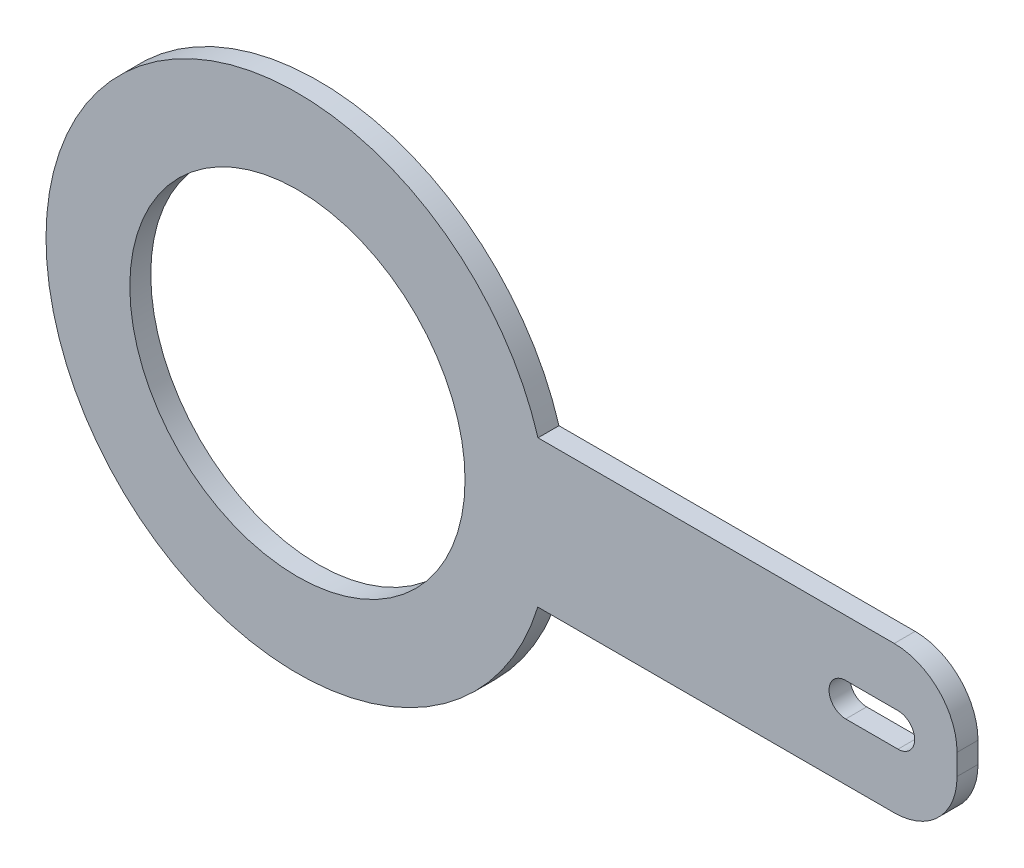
ISO-10303-21;
HEADER;
FILE_DESCRIPTION(('STEP AP214'),'2;1');
FILE_NAME('part.step','',(''),(''),'','','');
FILE_SCHEMA(('AUTOMOTIVE_DESIGN { 1 0 10303 214 1 1 1 1 }'));
ENDSEC;
DATA;
#1=APPLICATION_CONTEXT('core data for automotive mechanical design processes');
#2=APPLICATION_PROTOCOL_DEFINITION('international standard','automotive_design',2000,#1);
#3=PRODUCT_CONTEXT('',#1,'mechanical');
#4=PRODUCT('Part','Part','',(#3));
#5=PRODUCT_RELATED_PRODUCT_CATEGORY('part','',(#4));
#6=PRODUCT_DEFINITION_FORMATION('','',#4);
#7=PRODUCT_DEFINITION_CONTEXT('part definition',#1,'design');
#8=PRODUCT_DEFINITION('design','',#6,#7);
#9=PRODUCT_DEFINITION_SHAPE('','',#8);
#10=(LENGTH_UNIT() NAMED_UNIT(*) SI_UNIT(.MILLI.,.METRE.));
#11=(NAMED_UNIT(*) PLANE_ANGLE_UNIT() SI_UNIT($,.RADIAN.));
#12=(NAMED_UNIT(*) SI_UNIT($,.STERADIAN.) SOLID_ANGLE_UNIT());
#13=UNCERTAINTY_MEASURE_WITH_UNIT(LENGTH_MEASURE(1.E-05),#10,'distance_accuracy_value','');
#14=(GEOMETRIC_REPRESENTATION_CONTEXT(3) GLOBAL_UNCERTAINTY_ASSIGNED_CONTEXT((#13)) GLOBAL_UNIT_ASSIGNED_CONTEXT((#10,
#11,#12)) REPRESENTATION_CONTEXT('',''));
#15=CARTESIAN_POINT('',(0.,0.,0.));
#16=DIRECTION('',(0.,0.,1.));
#17=DIRECTION('',(1.,0.,0.));
#18=AXIS2_PLACEMENT_3D('',#15,#16,#17);
#19=CARTESIAN_POINT('',(0.,0.,0.5));
#20=DIRECTION('',(0.,0.,1.));
#21=DIRECTION('',(1.,0.,0.));
#22=AXIS2_PLACEMENT_3D('',#19,#20,#21);
#23=PLANE('',#22);
#24=CARTESIAN_POINT('',(13.0849969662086,0.,0.5));
#25=DIRECTION('',(0.,0.,1.));
#26=DIRECTION('',(1.,0.,0.));
#27=AXIS2_PLACEMENT_3D('',#24,#25,#26);
#28=CIRCLE('',#27,0.397804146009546);
#29=CARTESIAN_POINT('',(13.0849969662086,0.397804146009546,0.5));
#30=VERTEX_POINT('',#29);
#31=CARTESIAN_POINT('',(13.0849969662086,-0.397804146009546,0.5));
#32=VERTEX_POINT('',#31);
#33=EDGE_CURVE('E46',#30,#32,#28,.T.);
#34=ORIENTED_EDGE('',*,*,#33,.F.);
#35=DIRECTION('',(-1.,0.,0.));
#36=VECTOR('',#35,1.);
#37=CARTESIAN_POINT('',(13.0849969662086,0.397804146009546,0.5));
#38=LINE('',#37,#36);
#39=CARTESIAN_POINT('',(14.3321667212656,0.397804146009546,0.5));
#40=VERTEX_POINT('',#39);
#41=EDGE_CURVE('E126',#40,#30,#38,.T.);
#42=ORIENTED_EDGE('',*,*,#41,.F.);
#43=CARTESIAN_POINT('',(14.3321667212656,0.,0.5));
#44=DIRECTION('',(0.,0.,1.));
#45=DIRECTION('',(1.,0.,0.));
#46=AXIS2_PLACEMENT_3D('',#43,#44,#45);
#47=CIRCLE('',#46,0.397804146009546);
#48=CARTESIAN_POINT('',(14.3321667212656,-0.397804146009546,0.5));
#49=VERTEX_POINT('',#48);
#50=EDGE_CURVE('E129',#49,#40,#47,.T.);
#51=ORIENTED_EDGE('',*,*,#50,.F.);
#52=DIRECTION('',(1.,0.,0.));
#53=VECTOR('',#52,1.);
#54=CARTESIAN_POINT('',(13.0849969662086,-0.397804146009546,0.5));
#55=LINE('',#54,#53);
#56=EDGE_CURVE('E135',#32,#49,#55,.T.);
#57=ORIENTED_EDGE('',*,*,#56,.F.);
#58=EDGE_LOOP('',(#34,#42,#51,#57));
#59=FACE_BOUND('',#58,.T.);
#60=CARTESIAN_POINT('',(0.,0.,0.5));
#61=DIRECTION('',(0.,0.,1.));
#62=DIRECTION('',(1.,0.,0.));
#63=AXIS2_PLACEMENT_3D('',#60,#61,#62);
#64=CIRCLE('',#63,6.);
#65=CARTESIAN_POINT('',(5.74175784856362,1.74132616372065,0.5));
#66=VERTEX_POINT('',#65);
#67=CARTESIAN_POINT('',(5.73646810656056,-1.75867383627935,0.5));
#68=VERTEX_POINT('',#67);
#69=EDGE_CURVE('E151',#66,#68,#64,.T.);
#70=ORIENTED_EDGE('',*,*,#69,.T.);
#71=DIRECTION('',(1.,0.,0.));
#72=VECTOR('',#71,1.);
#73=CARTESIAN_POINT('',(5.73646810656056,-1.75867383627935,0.5));
#74=LINE('',#73,#72);
#75=CARTESIAN_POINT('',(14.2417578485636,-1.75867383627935,0.5));
#76=VERTEX_POINT('',#75);
#77=EDGE_CURVE('E154',#68,#76,#74,.T.);
#78=ORIENTED_EDGE('',*,*,#77,.T.);
#79=CARTESIAN_POINT('',(14.2417578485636,-0.258673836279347,0.5));
#80=DIRECTION('',(0.,0.,1.));
#81=DIRECTION('',(1.,0.,0.));
#82=AXIS2_PLACEMENT_3D('',#79,#80,#81);
#83=CIRCLE('',#82,1.5);
#84=CARTESIAN_POINT('',(15.7417578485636,-0.258673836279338,0.5));
#85=VERTEX_POINT('',#84);
#86=EDGE_CURVE('E157',#76,#85,#83,.T.);
#87=ORIENTED_EDGE('',*,*,#86,.T.);
#88=DIRECTION('',(0.,1.,0.));
#89=VECTOR('',#88,1.);
#90=CARTESIAN_POINT('',(15.7417578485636,0.24132616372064,0.5));
#91=LINE('',#90,#89);
#92=CARTESIAN_POINT('',(15.7417578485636,0.24132616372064,0.5));
#93=VERTEX_POINT('',#92);
#94=EDGE_CURVE('E159',#85,#93,#91,.T.);
#95=ORIENTED_EDGE('',*,*,#94,.T.);
#96=CARTESIAN_POINT('',(14.2417578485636,0.241326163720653,0.5));
#97=DIRECTION('',(0.,0.,1.));
#98=DIRECTION('',(-1.,0.,0.));
#99=AXIS2_PLACEMENT_3D('',#96,#97,#98);
#100=CIRCLE('',#99,1.5);
#101=CARTESIAN_POINT('',(14.2417578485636,1.74132616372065,0.5));
#102=VERTEX_POINT('',#101);
#103=EDGE_CURVE('E161',#93,#102,#100,.T.);
#104=ORIENTED_EDGE('',*,*,#103,.T.);
#105=DIRECTION('',(-1.,0.,0.));
#106=VECTOR('',#105,1.);
#107=CARTESIAN_POINT('',(5.74175784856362,1.74132616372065,0.5));
#108=LINE('',#107,#106);
#109=EDGE_CURVE('E163',#102,#66,#108,.T.);
#110=ORIENTED_EDGE('',*,*,#109,.T.);
#111=EDGE_LOOP('',(#70,#78,#87,#95,#104,#110));
#112=FACE_BOUND('',#111,.T.);
#113=CARTESIAN_POINT('',(0.,0.,0.5));
#114=DIRECTION('',(0.,0.,1.));
#115=DIRECTION('',(1.,0.,0.));
#116=AXIS2_PLACEMENT_3D('',#113,#114,#115);
#117=CIRCLE('',#116,4.);
#118=CARTESIAN_POINT('',(4.,0.,0.5));
#119=VERTEX_POINT('',#118);
#120=EDGE_CURVE('E145',#119,#119,#117,.T.);
#121=ORIENTED_EDGE('',*,*,#120,.F.);
#122=EDGE_LOOP('',(#121));
#123=FACE_BOUND('',#122,.T.);
#124=ADVANCED_FACE('F31',(#59,#112,#123),#23,.T.);
#125=CARTESIAN_POINT('',(0.,0.,0.));
#126=DIRECTION('',(0.,0.,1.));
#127=DIRECTION('',(1.,0.,0.));
#128=AXIS2_PLACEMENT_3D('',#125,#126,#127);
#129=PLANE('',#128);
#130=DIRECTION('',(-1.,0.,0.));
#131=VECTOR('',#130,1.);
#132=CARTESIAN_POINT('',(13.0849969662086,0.397804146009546,0.));
#133=LINE('',#132,#131);
#134=CARTESIAN_POINT('',(14.3321667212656,0.397804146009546,0.));
#135=VERTEX_POINT('',#134);
#136=CARTESIAN_POINT('',(13.0849969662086,0.397804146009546,0.));
#137=VERTEX_POINT('',#136);
#138=EDGE_CURVE('E116',#135,#137,#133,.T.);
#139=ORIENTED_EDGE('',*,*,#138,.T.);
#140=CARTESIAN_POINT('',(13.0849969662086,0.,0.));
#141=DIRECTION('',(0.,0.,1.));
#142=DIRECTION('',(1.,0.,0.));
#143=AXIS2_PLACEMENT_3D('',#140,#141,#142);
#144=CIRCLE('',#143,0.397804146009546);
#145=CARTESIAN_POINT('',(13.0849969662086,-0.397804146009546,0.));
#146=VERTEX_POINT('',#145);
#147=EDGE_CURVE('E110',#137,#146,#144,.T.);
#148=ORIENTED_EDGE('',*,*,#147,.T.);
#149=DIRECTION('',(1.,0.,0.));
#150=VECTOR('',#149,1.);
#151=CARTESIAN_POINT('',(13.0849969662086,-0.397804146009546,0.));
#152=LINE('',#151,#150);
#153=CARTESIAN_POINT('',(14.3321667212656,-0.397804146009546,0.));
#154=VERTEX_POINT('',#153);
#155=EDGE_CURVE('E119',#146,#154,#152,.T.);
#156=ORIENTED_EDGE('',*,*,#155,.T.);
#157=CARTESIAN_POINT('',(14.3321667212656,0.,0.));
#158=DIRECTION('',(0.,0.,1.));
#159=DIRECTION('',(1.,0.,0.));
#160=AXIS2_PLACEMENT_3D('',#157,#158,#159);
#161=CIRCLE('',#160,0.397804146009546);
#162=EDGE_CURVE('E54',#154,#135,#161,.T.);
#163=ORIENTED_EDGE('',*,*,#162,.T.);
#164=EDGE_LOOP('',(#139,#148,#156,#163));
#165=FACE_BOUND('',#164,.T.);
#166=CARTESIAN_POINT('',(0.,0.,0.));
#167=DIRECTION('',(0.,0.,1.));
#168=DIRECTION('',(1.,0.,0.));
#169=AXIS2_PLACEMENT_3D('',#166,#167,#168);
#170=CIRCLE('',#169,6.);
#171=CARTESIAN_POINT('',(5.74175784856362,1.74132616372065,0.));
#172=VERTEX_POINT('',#171);
#173=CARTESIAN_POINT('',(5.73646810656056,-1.75867383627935,0.));
#174=VERTEX_POINT('',#173);
#175=EDGE_CURVE('E148',#172,#174,#170,.T.);
#176=ORIENTED_EDGE('',*,*,#175,.F.);
#177=DIRECTION('',(-1.,0.,0.));
#178=VECTOR('',#177,1.);
#179=CARTESIAN_POINT('',(5.74175784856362,1.74132616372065,0.));
#180=LINE('',#179,#178);
#181=CARTESIAN_POINT('',(14.2417578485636,1.74132616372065,0.));
#182=VERTEX_POINT('',#181);
#183=EDGE_CURVE('E155',#182,#172,#180,.T.);
#184=ORIENTED_EDGE('',*,*,#183,.F.);
#185=CARTESIAN_POINT('',(14.2417578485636,0.241326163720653,0.));
#186=DIRECTION('',(0.,0.,1.));
#187=DIRECTION('',(-1.,0.,0.));
#188=AXIS2_PLACEMENT_3D('',#185,#186,#187);
#189=CIRCLE('',#188,1.5);
#190=CARTESIAN_POINT('',(15.7417578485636,0.24132616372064,0.));
#191=VERTEX_POINT('',#190);
#192=EDGE_CURVE('E174',#191,#182,#189,.T.);
#193=ORIENTED_EDGE('',*,*,#192,.F.);
#194=DIRECTION('',(0.,1.,0.));
#195=VECTOR('',#194,1.);
#196=CARTESIAN_POINT('',(15.7417578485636,0.24132616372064,0.));
#197=LINE('',#196,#195);
#198=CARTESIAN_POINT('',(15.7417578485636,-0.258673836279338,0.));
#199=VERTEX_POINT('',#198);
#200=EDGE_CURVE('E172',#199,#191,#197,.T.);
#201=ORIENTED_EDGE('',*,*,#200,.F.);
#202=CARTESIAN_POINT('',(14.2417578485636,-0.258673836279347,0.));
#203=DIRECTION('',(0.,0.,1.));
#204=DIRECTION('',(1.,0.,0.));
#205=AXIS2_PLACEMENT_3D('',#202,#203,#204);
#206=CIRCLE('',#205,1.5);
#207=CARTESIAN_POINT('',(14.2417578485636,-1.75867383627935,0.));
#208=VERTEX_POINT('',#207);
#209=EDGE_CURVE('E170',#208,#199,#206,.T.);
#210=ORIENTED_EDGE('',*,*,#209,.F.);
#211=DIRECTION('',(1.,0.,0.));
#212=VECTOR('',#211,1.);
#213=CARTESIAN_POINT('',(5.73646810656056,-1.75867383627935,0.));
#214=LINE('',#213,#212);
#215=EDGE_CURVE('E168',#174,#208,#214,.T.);
#216=ORIENTED_EDGE('',*,*,#215,.F.);
#217=EDGE_LOOP('',(#176,#184,#193,#201,#210,#216));
#218=FACE_BOUND('',#217,.T.);
#219=CARTESIAN_POINT('',(0.,0.,0.));
#220=DIRECTION('',(0.,0.,1.));
#221=DIRECTION('',(1.,0.,0.));
#222=AXIS2_PLACEMENT_3D('',#219,#220,#221);
#223=CIRCLE('',#222,4.);
#224=CARTESIAN_POINT('',(4.,0.,0.));
#225=VERTEX_POINT('',#224);
#226=EDGE_CURVE('E141',#225,#225,#223,.T.);
#227=ORIENTED_EDGE('',*,*,#226,.T.);
#228=EDGE_LOOP('',(#227));
#229=FACE_BOUND('',#228,.T.);
#230=ADVANCED_FACE('F123',(#165,#218,#229),#129,.F.);
#231=CARTESIAN_POINT('',(0.,0.,0.5));
#232=DIRECTION('',(0.,0.,-1.));
#233=DIRECTION('',(-1.,0.,0.));
#234=AXIS2_PLACEMENT_3D('',#231,#232,#233);
#235=CYLINDRICAL_SURFACE('',#234,6.);
#236=ORIENTED_EDGE('',*,*,#175,.T.);
#237=DIRECTION('',(0.,0.,-1.));
#238=VECTOR('',#237,1.);
#239=CARTESIAN_POINT('',(5.73646810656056,-1.75867383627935,0.5));
#240=LINE('',#239,#238);
#241=EDGE_CURVE('E11',#68,#174,#240,.T.);
#242=ORIENTED_EDGE('',*,*,#241,.F.);
#243=ORIENTED_EDGE('',*,*,#69,.F.);
#244=DIRECTION('',(0.,0.,-1.));
#245=VECTOR('',#244,1.);
#246=CARTESIAN_POINT('',(5.74175784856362,1.74132616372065,0.5));
#247=LINE('',#246,#245);
#248=EDGE_CURVE('E165',#66,#172,#247,.T.);
#249=ORIENTED_EDGE('',*,*,#248,.T.);
#250=EDGE_LOOP('',(#236,#242,#243,#249));
#251=FACE_BOUND('',#250,.T.);
#252=ADVANCED_FACE('F33',(#251),#235,.T.);
#253=CARTESIAN_POINT('',(5.73646810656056,-1.75867383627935,0.5));
#254=DIRECTION('',(0.,1.,0.));
#255=DIRECTION('',(-1.,0.,0.));
#256=AXIS2_PLACEMENT_3D('',#253,#254,#255);
#257=PLANE('',#256);
#258=ORIENTED_EDGE('',*,*,#215,.T.);
#259=DIRECTION('',(0.,0.,-1.));
#260=VECTOR('',#259,1.);
#261=CARTESIAN_POINT('',(14.2417578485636,-1.75867383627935,0.5));
#262=LINE('',#261,#260);
#263=EDGE_CURVE('E39',#76,#208,#262,.T.);
#264=ORIENTED_EDGE('',*,*,#263,.F.);
#265=ORIENTED_EDGE('',*,*,#77,.F.);
#266=ORIENTED_EDGE('',*,*,#241,.T.);
#267=EDGE_LOOP('',(#258,#264,#265,#266));
#268=FACE_BOUND('',#267,.T.);
#269=ADVANCED_FACE('F214',(#268),#257,.F.);
#270=CARTESIAN_POINT('',(14.2417578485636,-0.258673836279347,0.5));
#271=DIRECTION('',(0.,0.,-1.));
#272=DIRECTION('',(-1.,0.,0.));
#273=AXIS2_PLACEMENT_3D('',#270,#271,#272);
#274=CYLINDRICAL_SURFACE('',#273,1.5);
#275=ORIENTED_EDGE('',*,*,#209,.T.);
#276=DIRECTION('',(0.,0.,-1.));
#277=VECTOR('',#276,1.);
#278=CARTESIAN_POINT('',(15.7417578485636,-0.258673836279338,0.5));
#279=LINE('',#278,#277);
#280=EDGE_CURVE('E185',#85,#199,#279,.T.);
#281=ORIENTED_EDGE('',*,*,#280,.F.);
#282=ORIENTED_EDGE('',*,*,#86,.F.);
#283=ORIENTED_EDGE('',*,*,#263,.T.);
#284=EDGE_LOOP('',(#275,#281,#282,#283));
#285=FACE_BOUND('',#284,.T.);
#286=ADVANCED_FACE('F192',(#285),#274,.T.);
#287=CARTESIAN_POINT('',(15.7417578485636,0.24132616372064,0.5));
#288=DIRECTION('',(-1.,0.,0.));
#289=DIRECTION('',(0.,0.,1.));
#290=AXIS2_PLACEMENT_3D('',#287,#288,#289);
#291=PLANE('',#290);
#292=ORIENTED_EDGE('',*,*,#200,.T.);
#293=DIRECTION('',(0.,0.,-1.));
#294=VECTOR('',#293,1.);
#295=CARTESIAN_POINT('',(15.7417578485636,0.24132616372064,0.5));
#296=LINE('',#295,#294);
#297=EDGE_CURVE('E182',#93,#191,#296,.T.);
#298=ORIENTED_EDGE('',*,*,#297,.F.);
#299=ORIENTED_EDGE('',*,*,#94,.F.);
#300=ORIENTED_EDGE('',*,*,#280,.T.);
#301=EDGE_LOOP('',(#292,#298,#299,#300));
#302=FACE_BOUND('',#301,.T.);
#303=ADVANCED_FACE('F202',(#302),#291,.F.);
#304=CARTESIAN_POINT('',(14.2417578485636,0.241326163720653,0.5));
#305=DIRECTION('',(0.,0.,-1.));
#306=DIRECTION('',(-1.,0.,0.));
#307=AXIS2_PLACEMENT_3D('',#304,#305,#306);
#308=CYLINDRICAL_SURFACE('',#307,1.5);
#309=ORIENTED_EDGE('',*,*,#192,.T.);
#310=DIRECTION('',(0.,0.,-1.));
#311=VECTOR('',#310,1.);
#312=CARTESIAN_POINT('',(14.2417578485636,1.74132616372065,0.5));
#313=LINE('',#312,#311);
#314=EDGE_CURVE('E179',#102,#182,#313,.T.);
#315=ORIENTED_EDGE('',*,*,#314,.F.);
#316=ORIENTED_EDGE('',*,*,#103,.F.);
#317=ORIENTED_EDGE('',*,*,#297,.T.);
#318=EDGE_LOOP('',(#309,#315,#316,#317));
#319=FACE_BOUND('',#318,.T.);
#320=ADVANCED_FACE('F206',(#319),#308,.T.);
#321=CARTESIAN_POINT('',(5.74175784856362,1.74132616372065,0.5));
#322=DIRECTION('',(0.,-1.,0.));
#323=DIRECTION('',(1.,0.,0.));
#324=AXIS2_PLACEMENT_3D('',#321,#322,#323);
#325=PLANE('',#324);
#326=ORIENTED_EDGE('',*,*,#183,.T.);
#327=ORIENTED_EDGE('',*,*,#248,.F.);
#328=ORIENTED_EDGE('',*,*,#109,.F.);
#329=ORIENTED_EDGE('',*,*,#314,.T.);
#330=EDGE_LOOP('',(#326,#327,#328,#329));
#331=FACE_BOUND('',#330,.T.);
#332=ADVANCED_FACE('F217',(#331),#325,.F.);
#333=CARTESIAN_POINT('',(0.,0.,0.5));
#334=DIRECTION('',(0.,0.,-1.));
#335=DIRECTION('',(-1.,0.,0.));
#336=AXIS2_PLACEMENT_3D('',#333,#334,#335);
#337=CYLINDRICAL_SURFACE('',#336,4.);
#338=ORIENTED_EDGE('',*,*,#120,.T.);
#339=EDGE_LOOP('',(#338));
#340=FACE_BOUND('',#339,.T.);
#341=ORIENTED_EDGE('',*,*,#226,.F.);
#342=EDGE_LOOP('',(#341));
#343=FACE_BOUND('',#342,.T.);
#344=ADVANCED_FACE('F219',(#340,#343),#337,.F.);
#345=CARTESIAN_POINT('',(13.0849969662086,0.,0.));
#346=DIRECTION('',(0.,0.,1.));
#347=DIRECTION('',(1.,0.,0.));
#348=AXIS2_PLACEMENT_3D('',#345,#346,#347);
#349=CYLINDRICAL_SURFACE('',#348,0.397804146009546);
#350=ORIENTED_EDGE('',*,*,#33,.T.);
#351=DIRECTION('',(0.,0.,1.));
#352=VECTOR('',#351,1.);
#353=CARTESIAN_POINT('',(13.0849969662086,-0.397804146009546,0.));
#354=LINE('',#353,#352);
#355=EDGE_CURVE('E106',#146,#32,#354,.T.);
#356=ORIENTED_EDGE('',*,*,#355,.F.);
#357=ORIENTED_EDGE('',*,*,#147,.F.);
#358=DIRECTION('',(0.,0.,1.));
#359=VECTOR('',#358,1.);
#360=CARTESIAN_POINT('',(13.0849969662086,0.397804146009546,0.));
#361=LINE('',#360,#359);
#362=EDGE_CURVE('E139',#137,#30,#361,.T.);
#363=ORIENTED_EDGE('',*,*,#362,.T.);
#364=EDGE_LOOP('',(#350,#356,#357,#363));
#365=FACE_BOUND('',#364,.T.);
#366=ADVANCED_FACE('F108',(#365),#349,.F.);
#367=CARTESIAN_POINT('',(13.0849969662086,0.397804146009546,0.));
#368=DIRECTION('',(0.,1.,0.));
#369=DIRECTION('',(0.,0.,1.));
#370=AXIS2_PLACEMENT_3D('',#367,#368,#369);
#371=PLANE('',#370);
#372=ORIENTED_EDGE('',*,*,#41,.T.);
#373=ORIENTED_EDGE('',*,*,#362,.F.);
#374=ORIENTED_EDGE('',*,*,#138,.F.);
#375=DIRECTION('',(0.,0.,1.));
#376=VECTOR('',#375,1.);
#377=CARTESIAN_POINT('',(14.3321667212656,0.397804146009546,0.));
#378=LINE('',#377,#376);
#379=EDGE_CURVE('E142',#135,#40,#378,.T.);
#380=ORIENTED_EDGE('',*,*,#379,.T.);
#381=EDGE_LOOP('',(#372,#373,#374,#380));
#382=FACE_BOUND('',#381,.T.);
#383=ADVANCED_FACE('F238',(#382),#371,.F.);
#384=CARTESIAN_POINT('',(14.3321667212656,0.,0.));
#385=DIRECTION('',(0.,0.,1.));
#386=DIRECTION('',(1.,0.,0.));
#387=AXIS2_PLACEMENT_3D('',#384,#385,#386);
#388=CYLINDRICAL_SURFACE('',#387,0.397804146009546);
#389=ORIENTED_EDGE('',*,*,#50,.T.);
#390=ORIENTED_EDGE('',*,*,#379,.F.);
#391=ORIENTED_EDGE('',*,*,#162,.F.);
#392=DIRECTION('',(0.,0.,1.));
#393=VECTOR('',#392,1.);
#394=CARTESIAN_POINT('',(14.3321667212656,-0.397804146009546,0.));
#395=LINE('',#394,#393);
#396=EDGE_CURVE('E115',#154,#49,#395,.T.);
#397=ORIENTED_EDGE('',*,*,#396,.T.);
#398=EDGE_LOOP('',(#389,#390,#391,#397));
#399=FACE_BOUND('',#398,.T.);
#400=ADVANCED_FACE('F241',(#399),#388,.F.);
#401=CARTESIAN_POINT('',(13.0849969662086,-0.397804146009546,0.));
#402=DIRECTION('',(0.,-1.,0.));
#403=DIRECTION('',(0.,0.,-1.));
#404=AXIS2_PLACEMENT_3D('',#401,#402,#403);
#405=PLANE('',#404);
#406=ORIENTED_EDGE('',*,*,#56,.T.);
#407=ORIENTED_EDGE('',*,*,#396,.F.);
#408=ORIENTED_EDGE('',*,*,#155,.F.);
#409=ORIENTED_EDGE('',*,*,#355,.T.);
#410=EDGE_LOOP('',(#406,#407,#408,#409));
#411=FACE_BOUND('',#410,.T.);
#412=ADVANCED_FACE('F120',(#411),#405,.F.);
#413=CLOSED_SHELL('',(#124,#230,#252,#269,#286,#303,#320,#332,#344,#366,#383,#400,#412));
#414=MANIFOLD_SOLID_BREP('B2',#413);
#415=ADVANCED_BREP_SHAPE_REPRESENTATION('',(#18,#414),#14);
#416=SHAPE_DEFINITION_REPRESENTATION(#9,#415);
ENDSEC;
END-ISO-10303-21;
